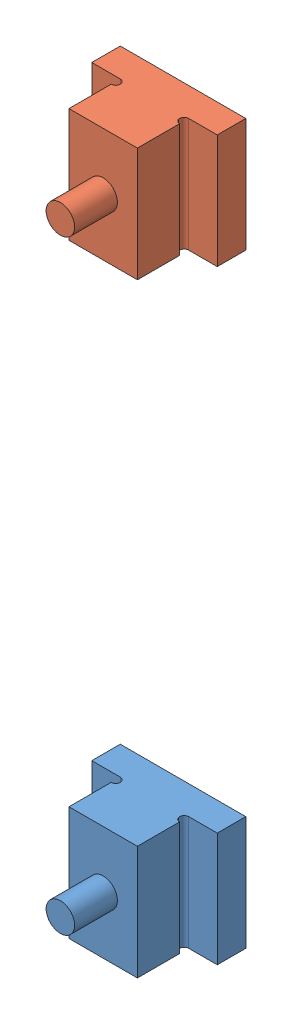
SolidWorks assembly img125_160-22k.SLDASM, configuration Default (file format 16000). Lengths in mm.
Overall size (22 126 21.5).
2 component instances, 2 part files, 0 mates.
Components (placement in the parent):
- img125_160-22k_01-1: img125_160-22k_01.SLDPRT [Default] at origin size (22 20 21.5)
- img125_160-22k_02-1: img125_160-22k_02.SLDPRT [Default] at (0 106 0) size (22 20 21.5)
